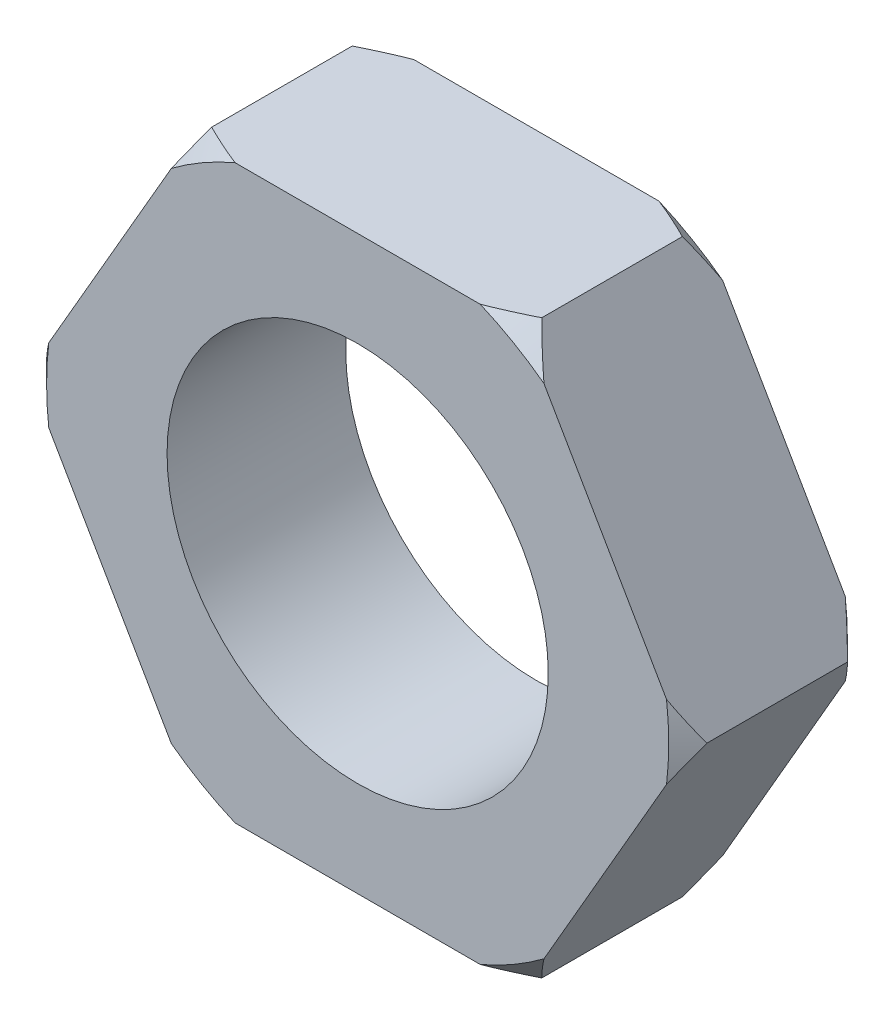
from build123d import *

# Parameters (mm, degrees)
ESQUISSE1_R          = 8
BASE_EXTRUSION_DEPTH = 7.5


with BuildPart() as part:
    # Esquisse1 → Base-Extrusion (new body)
    with BuildSketch(Plane.XY):
        Polygon((-6.92820323, 12), (-13.856406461, 0), (-6.92820323, -12), (6.92820323, -12), (13.856406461, 0), (6.92820323, 12), align=None)
        Circle(ESQUISSE1_R, mode=Mode.SUBTRACT)
    extrude(amount=-BASE_EXTRUSION_DEPTH)

    # Esquisse2 → Enl_vement de mati_re-R_volution1 (revolve, cut)
    with BuildSketch(Plane(origin=(0, 0, 0), x_dir=(1, 0, 0), z_dir=(0, 1, 0))):
        Polygon((-13.856406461, 7.5), (-13.056406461, 7.5), (-13.856406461, 6.7), align=None)
        Polygon((-13.856406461, 0), (-13.056406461, 0), (-13.856406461, 0.8), align=None)
    revolve(axis=Axis((0, 0, -8.931643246), (0, 0, 1)), mode=Mode.SUBTRACT)


solid = part.part
